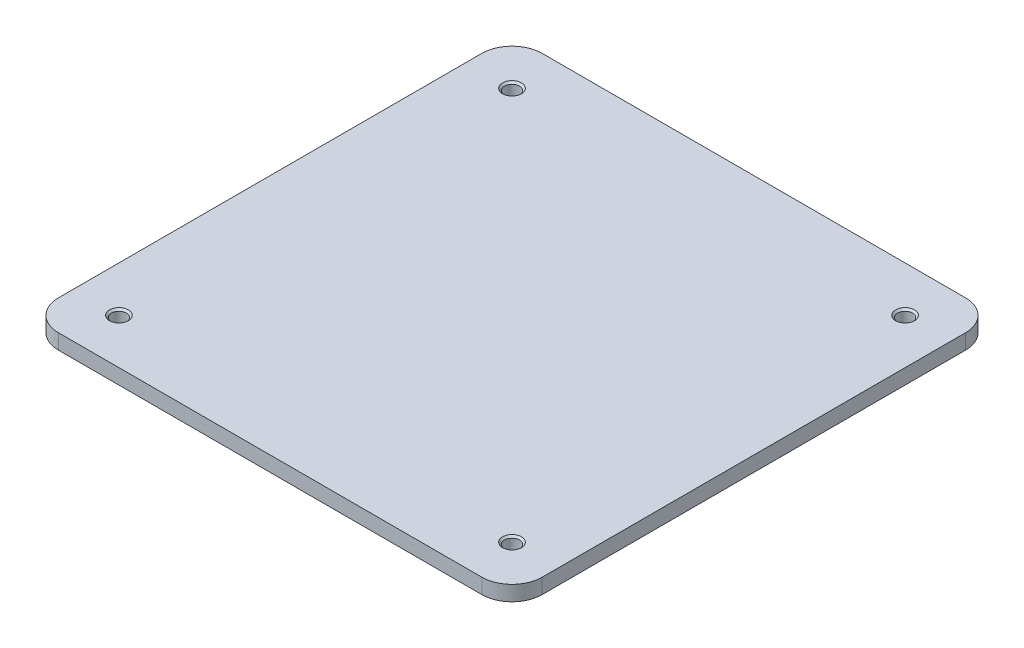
ISO-10303-21;
HEADER;
FILE_DESCRIPTION(('STEP AP214'),'2;1');
FILE_NAME('part.step','',(''),(''),'','','');
FILE_SCHEMA(('AUTOMOTIVE_DESIGN { 1 0 10303 214 1 1 1 1 }'));
ENDSEC;
DATA;
#1=APPLICATION_CONTEXT('core data for automotive mechanical design processes');
#2=APPLICATION_PROTOCOL_DEFINITION('international standard','automotive_design',2000,#1);
#3=PRODUCT_CONTEXT('',#1,'mechanical');
#4=PRODUCT('Part','Part','',(#3));
#5=PRODUCT_RELATED_PRODUCT_CATEGORY('part','',(#4));
#6=PRODUCT_DEFINITION_FORMATION('','',#4);
#7=PRODUCT_DEFINITION_CONTEXT('part definition',#1,'design');
#8=PRODUCT_DEFINITION('design','',#6,#7);
#9=PRODUCT_DEFINITION_SHAPE('','',#8);
#10=(LENGTH_UNIT() NAMED_UNIT(*) SI_UNIT(.MILLI.,.METRE.));
#11=(NAMED_UNIT(*) PLANE_ANGLE_UNIT() SI_UNIT($,.RADIAN.));
#12=(NAMED_UNIT(*) SI_UNIT($,.STERADIAN.) SOLID_ANGLE_UNIT());
#13=UNCERTAINTY_MEASURE_WITH_UNIT(LENGTH_MEASURE(1.E-05),#10,'distance_accuracy_value','');
#14=(GEOMETRIC_REPRESENTATION_CONTEXT(3) GLOBAL_UNCERTAINTY_ASSIGNED_CONTEXT((#13)) GLOBAL_UNIT_ASSIGNED_CONTEXT((#10,
#11,#12)) REPRESENTATION_CONTEXT('',''));
#15=CARTESIAN_POINT('',(0.,0.,0.));
#16=DIRECTION('',(0.,0.,1.));
#17=DIRECTION('',(1.,0.,0.));
#18=AXIS2_PLACEMENT_3D('',#15,#16,#17);
#19=CARTESIAN_POINT('',(101.6,6.35,-101.6));
#20=DIRECTION('',(-1.,0.,0.));
#21=DIRECTION('',(0.,0.,1.));
#22=AXIS2_PLACEMENT_3D('',#19,#20,#21);
#23=PLANE('',#22);
#24=DIRECTION('',(0.,0.,-1.));
#25=VECTOR('',#24,1.);
#26=CARTESIAN_POINT('',(101.6,6.35,-101.6));
#27=LINE('',#26,#25);
#28=CARTESIAN_POINT('',(101.6,6.35,88.9));
#29=VERTEX_POINT('',#28);
#30=CARTESIAN_POINT('',(101.6,6.35,-88.9));
#31=VERTEX_POINT('',#30);
#32=EDGE_CURVE('E133',#29,#31,#27,.T.);
#33=ORIENTED_EDGE('',*,*,#32,.F.);
#34=DIRECTION('',(0.,-1.,0.));
#35=VECTOR('',#34,1.);
#36=CARTESIAN_POINT('',(101.6,6.35,88.9));
#37=LINE('',#36,#35);
#38=CARTESIAN_POINT('',(101.6,0.,88.9));
#39=VERTEX_POINT('',#38);
#40=EDGE_CURVE('E118',#29,#39,#37,.T.);
#41=ORIENTED_EDGE('',*,*,#40,.T.);
#42=DIRECTION('',(0.,0.,-1.));
#43=VECTOR('',#42,1.);
#44=CARTESIAN_POINT('',(101.6,0.,-101.6));
#45=LINE('',#44,#43);
#46=CARTESIAN_POINT('',(101.6,0.,-88.9));
#47=VERTEX_POINT('',#46);
#48=EDGE_CURVE('E130',#39,#47,#45,.T.);
#49=ORIENTED_EDGE('',*,*,#48,.T.);
#50=DIRECTION('',(0.,-1.,0.));
#51=VECTOR('',#50,1.);
#52=CARTESIAN_POINT('',(101.6,6.35,-88.9));
#53=LINE('',#52,#51);
#54=EDGE_CURVE('E135',#47,#31,#53,.F.);
#55=ORIENTED_EDGE('',*,*,#54,.T.);
#56=EDGE_LOOP('',(#33,#41,#49,#55));
#57=FACE_BOUND('',#56,.T.);
#58=ADVANCED_FACE('F48',(#57),#23,.F.);
#59=CARTESIAN_POINT('',(-101.6,6.35,-101.6));
#60=DIRECTION('',(0.,0.,1.));
#61=DIRECTION('',(1.,0.,0.));
#62=AXIS2_PLACEMENT_3D('',#59,#60,#61);
#63=PLANE('',#62);
#64=DIRECTION('',(-1.,0.,0.));
#65=VECTOR('',#64,1.);
#66=CARTESIAN_POINT('',(-101.6,0.,-101.6));
#67=LINE('',#66,#65);
#68=CARTESIAN_POINT('',(88.9,0.,-101.6));
#69=VERTEX_POINT('',#68);
#70=CARTESIAN_POINT('',(-88.9,0.,-101.6));
#71=VERTEX_POINT('',#70);
#72=EDGE_CURVE('E139',#69,#71,#67,.T.);
#73=ORIENTED_EDGE('',*,*,#72,.T.);
#74=DIRECTION('',(0.,-1.,0.));
#75=VECTOR('',#74,1.);
#76=CARTESIAN_POINT('',(-88.9,6.35,-101.6));
#77=LINE('',#76,#75);
#78=CARTESIAN_POINT('',(-88.9,6.35,-101.6));
#79=VERTEX_POINT('',#78);
#80=EDGE_CURVE('E13',#71,#79,#77,.F.);
#81=ORIENTED_EDGE('',*,*,#80,.T.);
#82=DIRECTION('',(-1.,0.,0.));
#83=VECTOR('',#82,1.);
#84=CARTESIAN_POINT('',(-101.6,6.35,-101.6));
#85=LINE('',#84,#83);
#86=CARTESIAN_POINT('',(88.9,6.35,-101.6));
#87=VERTEX_POINT('',#86);
#88=EDGE_CURVE('E203',#87,#79,#85,.T.);
#89=ORIENTED_EDGE('',*,*,#88,.F.);
#90=DIRECTION('',(0.,-1.,0.));
#91=VECTOR('',#90,1.);
#92=CARTESIAN_POINT('',(88.9,6.35,-101.6));
#93=LINE('',#92,#91);
#94=EDGE_CURVE('E56',#87,#69,#93,.T.);
#95=ORIENTED_EDGE('',*,*,#94,.T.);
#96=EDGE_LOOP('',(#73,#81,#89,#95));
#97=FACE_BOUND('',#96,.T.);
#98=ADVANCED_FACE('F201',(#97),#63,.F.);
#99=CARTESIAN_POINT('',(-101.6,6.35,-101.6));
#100=DIRECTION('',(1.,0.,0.));
#101=DIRECTION('',(0.,0.,-1.));
#102=AXIS2_PLACEMENT_3D('',#99,#100,#101);
#103=PLANE('',#102);
#104=DIRECTION('',(0.,0.,1.));
#105=VECTOR('',#104,1.);
#106=CARTESIAN_POINT('',(-101.6,0.,-101.6));
#107=LINE('',#106,#105);
#108=CARTESIAN_POINT('',(-101.6,0.,-88.9));
#109=VERTEX_POINT('',#108);
#110=CARTESIAN_POINT('',(-101.6,0.,88.9));
#111=VERTEX_POINT('',#110);
#112=EDGE_CURVE('E143',#109,#111,#107,.T.);
#113=ORIENTED_EDGE('',*,*,#112,.T.);
#114=DIRECTION('',(0.,-1.,0.));
#115=VECTOR('',#114,1.);
#116=CARTESIAN_POINT('',(-101.6,6.35,88.9));
#117=LINE('',#116,#115);
#118=CARTESIAN_POINT('',(-101.6,6.35,88.9));
#119=VERTEX_POINT('',#118);
#120=EDGE_CURVE('E63',#111,#119,#117,.F.);
#121=ORIENTED_EDGE('',*,*,#120,.T.);
#122=DIRECTION('',(0.,0.,1.));
#123=VECTOR('',#122,1.);
#124=CARTESIAN_POINT('',(-101.6,6.35,-101.6));
#125=LINE('',#124,#123);
#126=CARTESIAN_POINT('',(-101.6,6.35,-88.9));
#127=VERTEX_POINT('',#126);
#128=EDGE_CURVE('E211',#127,#119,#125,.T.);
#129=ORIENTED_EDGE('',*,*,#128,.F.);
#130=DIRECTION('',(0.,-1.,0.));
#131=VECTOR('',#130,1.);
#132=CARTESIAN_POINT('',(-101.6,6.35,-88.9));
#133=LINE('',#132,#131);
#134=EDGE_CURVE('E194',#127,#109,#133,.T.);
#135=ORIENTED_EDGE('',*,*,#134,.T.);
#136=EDGE_LOOP('',(#113,#121,#129,#135));
#137=FACE_BOUND('',#136,.T.);
#138=ADVANCED_FACE('F210',(#137),#103,.F.);
#139=CARTESIAN_POINT('',(-101.6,6.35,101.6));
#140=DIRECTION('',(0.,0.,-1.));
#141=DIRECTION('',(-1.,0.,0.));
#142=AXIS2_PLACEMENT_3D('',#139,#140,#141);
#143=PLANE('',#142);
#144=DIRECTION('',(1.,0.,0.));
#145=VECTOR('',#144,1.);
#146=CARTESIAN_POINT('',(-101.6,0.,101.6));
#147=LINE('',#146,#145);
#148=CARTESIAN_POINT('',(-88.9,0.,101.6));
#149=VERTEX_POINT('',#148);
#150=CARTESIAN_POINT('',(88.9,0.,101.6));
#151=VERTEX_POINT('',#150);
#152=EDGE_CURVE('E153',#149,#151,#147,.T.);
#153=ORIENTED_EDGE('',*,*,#152,.T.);
#154=DIRECTION('',(0.,-1.,0.));
#155=VECTOR('',#154,1.);
#156=CARTESIAN_POINT('',(88.9,6.35,101.6));
#157=LINE('',#156,#155);
#158=CARTESIAN_POINT('',(88.9,6.35,101.6));
#159=VERTEX_POINT('',#158);
#160=EDGE_CURVE('E119',#151,#159,#157,.F.);
#161=ORIENTED_EDGE('',*,*,#160,.T.);
#162=DIRECTION('',(1.,0.,0.));
#163=VECTOR('',#162,1.);
#164=CARTESIAN_POINT('',(-101.6,6.35,101.6));
#165=LINE('',#164,#163);
#166=CARTESIAN_POINT('',(-88.9,6.35,101.6));
#167=VERTEX_POINT('',#166);
#168=EDGE_CURVE('E149',#167,#159,#165,.T.);
#169=ORIENTED_EDGE('',*,*,#168,.F.);
#170=DIRECTION('',(0.,-1.,0.));
#171=VECTOR('',#170,1.);
#172=CARTESIAN_POINT('',(-88.9,6.35,101.6));
#173=LINE('',#172,#171);
#174=EDGE_CURVE('E124',#167,#149,#173,.T.);
#175=ORIENTED_EDGE('',*,*,#174,.T.);
#176=EDGE_LOOP('',(#153,#161,#169,#175));
#177=FACE_BOUND('',#176,.T.);
#178=ADVANCED_FACE('F282',(#177),#143,.F.);
#179=CARTESIAN_POINT('',(0.,6.35,0.));
#180=DIRECTION('',(0.,1.,0.));
#181=DIRECTION('',(0.,0.,1.));
#182=AXIS2_PLACEMENT_3D('',#179,#180,#181);
#183=PLANE('',#182);
#184=CARTESIAN_POINT('',(-82.55,6.35,82.55));
#185=DIRECTION('',(0.,1.,0.));
#186=DIRECTION('',(0.,0.,1.));
#187=AXIS2_PLACEMENT_3D('',#184,#185,#186);
#188=CIRCLE('',#187,3.96875000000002);
#189=CARTESIAN_POINT('',(-82.55,6.35,86.51875));
#190=VERTEX_POINT('',#189);
#191=EDGE_CURVE('E167',#190,#190,#188,.F.);
#192=ORIENTED_EDGE('',*,*,#191,.T.);
#193=EDGE_LOOP('',(#192));
#194=FACE_BOUND('',#193,.T.);
#195=CARTESIAN_POINT('',(82.55,6.35,82.55));
#196=DIRECTION('',(0.,1.,0.));
#197=DIRECTION('',(0.,0.,1.));
#198=AXIS2_PLACEMENT_3D('',#195,#196,#197);
#199=CIRCLE('',#198,3.96875000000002);
#200=CARTESIAN_POINT('',(82.55,6.35,86.51875));
#201=VERTEX_POINT('',#200);
#202=EDGE_CURVE('E164',#201,#201,#199,.F.);
#203=ORIENTED_EDGE('',*,*,#202,.T.);
#204=EDGE_LOOP('',(#203));
#205=FACE_BOUND('',#204,.T.);
#206=CARTESIAN_POINT('',(82.55,6.35,-82.55));
#207=DIRECTION('',(0.,1.,0.));
#208=DIRECTION('',(0.,0.,1.));
#209=AXIS2_PLACEMENT_3D('',#206,#207,#208);
#210=CIRCLE('',#209,3.96874999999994);
#211=CARTESIAN_POINT('',(82.55,6.35,-78.5812500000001));
#212=VERTEX_POINT('',#211);
#213=EDGE_CURVE('E161',#212,#212,#210,.F.);
#214=ORIENTED_EDGE('',*,*,#213,.T.);
#215=EDGE_LOOP('',(#214));
#216=FACE_BOUND('',#215,.T.);
#217=CARTESIAN_POINT('',(-82.55,6.35,-82.55));
#218=DIRECTION('',(0.,1.,0.));
#219=DIRECTION('',(0.,0.,1.));
#220=AXIS2_PLACEMENT_3D('',#217,#218,#219);
#221=CIRCLE('',#220,3.96874999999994);
#222=CARTESIAN_POINT('',(-82.55,6.35,-78.5812500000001));
#223=VERTEX_POINT('',#222);
#224=EDGE_CURVE('E158',#223,#223,#221,.F.);
#225=ORIENTED_EDGE('',*,*,#224,.T.);
#226=EDGE_LOOP('',(#225));
#227=FACE_BOUND('',#226,.T.);
#228=ORIENTED_EDGE('',*,*,#168,.T.);
#229=CARTESIAN_POINT('',(88.9,6.35,88.9));
#230=DIRECTION('',(0.,1.,0.));
#231=DIRECTION('',(0.,0.,1.));
#232=AXIS2_PLACEMENT_3D('',#229,#230,#231);
#233=CIRCLE('',#232,12.7);
#234=EDGE_CURVE('E192',#159,#29,#233,.T.);
#235=ORIENTED_EDGE('',*,*,#234,.T.);
#236=ORIENTED_EDGE('',*,*,#32,.T.);
#237=CARTESIAN_POINT('',(88.9,6.35,-88.9));
#238=DIRECTION('',(0.,1.,0.));
#239=DIRECTION('',(0.,0.,1.));
#240=AXIS2_PLACEMENT_3D('',#237,#238,#239);
#241=CIRCLE('',#240,12.7);
#242=EDGE_CURVE('E187',#31,#87,#241,.T.);
#243=ORIENTED_EDGE('',*,*,#242,.T.);
#244=ORIENTED_EDGE('',*,*,#88,.T.);
#245=CARTESIAN_POINT('',(-88.9,6.35,-88.9));
#246=DIRECTION('',(0.,1.,0.));
#247=DIRECTION('',(0.,0.,1.));
#248=AXIS2_PLACEMENT_3D('',#245,#246,#247);
#249=CIRCLE('',#248,12.7);
#250=EDGE_CURVE('E70',#79,#127,#249,.T.);
#251=ORIENTED_EDGE('',*,*,#250,.T.);
#252=ORIENTED_EDGE('',*,*,#128,.T.);
#253=CARTESIAN_POINT('',(-88.9,6.35,88.9));
#254=DIRECTION('',(0.,1.,0.));
#255=DIRECTION('',(0.,0.,1.));
#256=AXIS2_PLACEMENT_3D('',#253,#254,#255);
#257=CIRCLE('',#256,12.7);
#258=EDGE_CURVE('E190',#119,#167,#257,.T.);
#259=ORIENTED_EDGE('',*,*,#258,.T.);
#260=EDGE_LOOP('',(#228,#235,#236,#243,#244,#251,#252,#259));
#261=FACE_BOUND('',#260,.T.);
#262=ADVANCED_FACE('F278',(#194,#205,#216,#227,#261),#183,.T.);
#263=CARTESIAN_POINT('',(0.,0.,0.));
#264=DIRECTION('',(0.,1.,0.));
#265=DIRECTION('',(0.,0.,1.));
#266=AXIS2_PLACEMENT_3D('',#263,#264,#265);
#267=PLANE('',#266);
#268=CARTESIAN_POINT('',(-82.55,0.,82.55));
#269=DIRECTION('',(0.,1.,0.));
#270=DIRECTION('',(0.,0.,1.));
#271=AXIS2_PLACEMENT_3D('',#268,#269,#270);
#272=CIRCLE('',#271,3.175);
#273=CARTESIAN_POINT('',(-82.55,0.,85.725));
#274=VERTEX_POINT('',#273);
#275=EDGE_CURVE('E217',#274,#274,#272,.T.);
#276=ORIENTED_EDGE('',*,*,#275,.T.);
#277=EDGE_LOOP('',(#276));
#278=FACE_BOUND('',#277,.T.);
#279=CARTESIAN_POINT('',(82.55,0.,82.55));
#280=DIRECTION('',(0.,1.,0.));
#281=DIRECTION('',(0.,0.,1.));
#282=AXIS2_PLACEMENT_3D('',#279,#280,#281);
#283=CIRCLE('',#282,3.175);
#284=CARTESIAN_POINT('',(82.55,0.,85.725));
#285=VERTEX_POINT('',#284);
#286=EDGE_CURVE('E220',#285,#285,#283,.T.);
#287=ORIENTED_EDGE('',*,*,#286,.T.);
#288=EDGE_LOOP('',(#287));
#289=FACE_BOUND('',#288,.T.);
#290=CARTESIAN_POINT('',(82.55,0.,-82.55));
#291=DIRECTION('',(0.,1.,0.));
#292=DIRECTION('',(0.,0.,1.));
#293=AXIS2_PLACEMENT_3D('',#290,#291,#292);
#294=CIRCLE('',#293,3.175);
#295=CARTESIAN_POINT('',(82.55,0.,-79.375));
#296=VERTEX_POINT('',#295);
#297=EDGE_CURVE('E146',#296,#296,#294,.T.);
#298=ORIENTED_EDGE('',*,*,#297,.T.);
#299=EDGE_LOOP('',(#298));
#300=FACE_BOUND('',#299,.T.);
#301=CARTESIAN_POINT('',(-82.55,0.,-82.55));
#302=DIRECTION('',(0.,1.,0.));
#303=DIRECTION('',(0.,0.,1.));
#304=AXIS2_PLACEMENT_3D('',#301,#302,#303);
#305=CIRCLE('',#304,3.175);
#306=CARTESIAN_POINT('',(-82.55,0.,-79.375));
#307=VERTEX_POINT('',#306);
#308=EDGE_CURVE('E140',#307,#307,#305,.T.);
#309=ORIENTED_EDGE('',*,*,#308,.T.);
#310=EDGE_LOOP('',(#309));
#311=FACE_BOUND('',#310,.T.);
#312=ORIENTED_EDGE('',*,*,#48,.F.);
#313=CARTESIAN_POINT('',(88.9,0.,88.9));
#314=DIRECTION('',(0.,1.,0.));
#315=DIRECTION('',(0.,0.,1.));
#316=AXIS2_PLACEMENT_3D('',#313,#314,#315);
#317=CIRCLE('',#316,12.7);
#318=EDGE_CURVE('E114',#39,#151,#317,.F.);
#319=ORIENTED_EDGE('',*,*,#318,.T.);
#320=ORIENTED_EDGE('',*,*,#152,.F.);
#321=CARTESIAN_POINT('',(-88.9,0.,88.9));
#322=DIRECTION('',(0.,1.,0.));
#323=DIRECTION('',(0.,0.,1.));
#324=AXIS2_PLACEMENT_3D('',#321,#322,#323);
#325=CIRCLE('',#324,12.7);
#326=EDGE_CURVE('E125',#149,#111,#325,.F.);
#327=ORIENTED_EDGE('',*,*,#326,.T.);
#328=ORIENTED_EDGE('',*,*,#112,.F.);
#329=CARTESIAN_POINT('',(-88.9,0.,-88.9));
#330=DIRECTION('',(0.,1.,0.));
#331=DIRECTION('',(0.,0.,1.));
#332=AXIS2_PLACEMENT_3D('',#329,#330,#331);
#333=CIRCLE('',#332,12.7);
#334=EDGE_CURVE('E181',#109,#71,#333,.F.);
#335=ORIENTED_EDGE('',*,*,#334,.T.);
#336=ORIENTED_EDGE('',*,*,#72,.F.);
#337=CARTESIAN_POINT('',(88.9,0.,-88.9));
#338=DIRECTION('',(0.,1.,0.));
#339=DIRECTION('',(0.,0.,1.));
#340=AXIS2_PLACEMENT_3D('',#337,#338,#339);
#341=CIRCLE('',#340,12.7);
#342=EDGE_CURVE('E134',#69,#47,#341,.F.);
#343=ORIENTED_EDGE('',*,*,#342,.T.);
#344=EDGE_LOOP('',(#312,#319,#320,#327,#328,#335,#336,#343));
#345=FACE_BOUND('',#344,.T.);
#346=ADVANCED_FACE('F137',(#278,#289,#300,#311,#345),#267,.F.);
#347=CARTESIAN_POINT('',(-82.55,0.,-82.55));
#348=DIRECTION('',(0.,1.,0.));
#349=DIRECTION('',(0.,0.,1.));
#350=AXIS2_PLACEMENT_3D('',#347,#348,#349);
#351=CYLINDRICAL_SURFACE('',#350,3.175);
#352=CARTESIAN_POINT('',(-82.55,5.55625000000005,-82.55));
#353=DIRECTION('',(0.,1.,0.));
#354=DIRECTION('',(0.,0.,1.));
#355=AXIS2_PLACEMENT_3D('',#352,#353,#354);
#356=CIRCLE('',#355,3.175);
#357=CARTESIAN_POINT('',(-82.55,5.55625000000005,-79.375));
#358=VERTEX_POINT('',#357);
#359=EDGE_CURVE('E176',#358,#358,#356,.T.);
#360=ORIENTED_EDGE('',*,*,#359,.T.);
#361=EDGE_LOOP('',(#360));
#362=FACE_BOUND('',#361,.T.);
#363=ORIENTED_EDGE('',*,*,#308,.F.);
#364=EDGE_LOOP('',(#363));
#365=FACE_BOUND('',#364,.T.);
#366=ADVANCED_FACE('F231',(#362,#365),#351,.F.);
#367=CARTESIAN_POINT('',(82.55,0.,-82.55));
#368=DIRECTION('',(0.,1.,0.));
#369=DIRECTION('',(0.,0.,1.));
#370=AXIS2_PLACEMENT_3D('',#367,#368,#369);
#371=CYLINDRICAL_SURFACE('',#370,3.175);
#372=CARTESIAN_POINT('',(82.55,5.55625000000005,-82.55));
#373=DIRECTION('',(0.,1.,0.));
#374=DIRECTION('',(0.,0.,1.));
#375=AXIS2_PLACEMENT_3D('',#372,#373,#374);
#376=CIRCLE('',#375,3.175);
#377=CARTESIAN_POINT('',(82.55,5.55625000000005,-79.375));
#378=VERTEX_POINT('',#377);
#379=EDGE_CURVE('E173',#378,#378,#376,.T.);
#380=ORIENTED_EDGE('',*,*,#379,.T.);
#381=EDGE_LOOP('',(#380));
#382=FACE_BOUND('',#381,.T.);
#383=ORIENTED_EDGE('',*,*,#297,.F.);
#384=EDGE_LOOP('',(#383));
#385=FACE_BOUND('',#384,.T.);
#386=ADVANCED_FACE('F228',(#382,#385),#371,.F.);
#387=CARTESIAN_POINT('',(82.55,0.,82.55));
#388=DIRECTION('',(0.,1.,0.));
#389=DIRECTION('',(0.,0.,1.));
#390=AXIS2_PLACEMENT_3D('',#387,#388,#389);
#391=CYLINDRICAL_SURFACE('',#390,3.175);
#392=CARTESIAN_POINT('',(82.55,5.55624999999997,82.55));
#393=DIRECTION('',(0.,1.,0.));
#394=DIRECTION('',(0.,0.,1.));
#395=AXIS2_PLACEMENT_3D('',#392,#393,#394);
#396=CIRCLE('',#395,3.175);
#397=CARTESIAN_POINT('',(82.55,5.55624999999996,85.725));
#398=VERTEX_POINT('',#397);
#399=EDGE_CURVE('E170',#398,#398,#396,.T.);
#400=ORIENTED_EDGE('',*,*,#399,.T.);
#401=EDGE_LOOP('',(#400));
#402=FACE_BOUND('',#401,.T.);
#403=ORIENTED_EDGE('',*,*,#286,.F.);
#404=EDGE_LOOP('',(#403));
#405=FACE_BOUND('',#404,.T.);
#406=ADVANCED_FACE('F230',(#402,#405),#391,.F.);
#407=CARTESIAN_POINT('',(-82.55,0.,82.55));
#408=DIRECTION('',(0.,1.,0.));
#409=DIRECTION('',(0.,0.,1.));
#410=AXIS2_PLACEMENT_3D('',#407,#408,#409);
#411=CYLINDRICAL_SURFACE('',#410,3.175);
#412=CARTESIAN_POINT('',(-82.55,5.55624999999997,82.55));
#413=DIRECTION('',(0.,1.,0.));
#414=DIRECTION('',(0.,0.,1.));
#415=AXIS2_PLACEMENT_3D('',#412,#413,#414);
#416=CIRCLE('',#415,3.175);
#417=CARTESIAN_POINT('',(-82.55,5.55624999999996,85.725));
#418=VERTEX_POINT('',#417);
#419=EDGE_CURVE('E155',#418,#418,#416,.T.);
#420=ORIENTED_EDGE('',*,*,#419,.T.);
#421=EDGE_LOOP('',(#420));
#422=FACE_BOUND('',#421,.T.);
#423=ORIENTED_EDGE('',*,*,#275,.F.);
#424=EDGE_LOOP('',(#423));
#425=FACE_BOUND('',#424,.T.);
#426=ADVANCED_FACE('F238',(#422,#425),#411,.F.);
#427=CARTESIAN_POINT('',(-82.55,5.55624999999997,82.55));
#428=DIRECTION('',(0.,1.,0.));
#429=DIRECTION('',(0.,0.,1.));
#430=AXIS2_PLACEMENT_3D('',#427,#428,#429);
#431=CONICAL_SURFACE('',#430,3.175,0.785398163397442);
#432=CARTESIAN_POINT('',(-82.55,6.35,86.51875));
#433=CARTESIAN_POINT('',(-82.55,6.34173177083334,86.5104817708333));
#434=CARTESIAN_POINT('',(-82.55,6.33346354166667,86.5022135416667));
#435=CARTESIAN_POINT('',(-82.55,6.31692708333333,86.4856770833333));
#436=CARTESIAN_POINT('',(-82.55,6.30865885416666,86.4774088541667));
#437=CARTESIAN_POINT('',(-82.55,6.29212239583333,86.4608723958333));
#438=CARTESIAN_POINT('',(-82.55,6.28385416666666,86.4526041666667));
#439=CARTESIAN_POINT('',(-82.55,6.26731770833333,86.4360677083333));
#440=CARTESIAN_POINT('',(-82.55,6.25904947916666,86.4277994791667));
#441=CARTESIAN_POINT('',(-82.55,6.24251302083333,86.4112630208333));
#442=CARTESIAN_POINT('',(-82.55,6.23424479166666,86.4029947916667));
#443=CARTESIAN_POINT('',(-82.55,6.21770833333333,86.3864583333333));
#444=CARTESIAN_POINT('',(-82.55,6.20944010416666,86.3781901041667));
#445=CARTESIAN_POINT('',(-82.55,6.19290364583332,86.3616536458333));
#446=CARTESIAN_POINT('',(-82.55,6.18463541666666,86.3533854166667));
#447=CARTESIAN_POINT('',(-82.55,6.16809895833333,86.3368489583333));
#448=CARTESIAN_POINT('',(-82.55,6.15983072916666,86.3285807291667));
#449=CARTESIAN_POINT('',(-82.55,6.14329427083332,86.3120442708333));
#450=CARTESIAN_POINT('',(-82.55,6.13502604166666,86.3037760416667));
#451=CARTESIAN_POINT('',(-82.55,6.11848958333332,86.2872395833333));
#452=CARTESIAN_POINT('',(-82.55,6.11022135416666,86.2789713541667));
#453=CARTESIAN_POINT('',(-82.55,6.09368489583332,86.2624348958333));
#454=CARTESIAN_POINT('',(-82.55,6.08541666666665,86.2541666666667));
#455=CARTESIAN_POINT('',(-82.55,6.06888020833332,86.2376302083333));
#456=CARTESIAN_POINT('',(-82.55,6.06061197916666,86.2293619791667));
#457=CARTESIAN_POINT('',(-82.55,6.04407552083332,86.2128255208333));
#458=CARTESIAN_POINT('',(-82.55,6.03580729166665,86.2045572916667));
#459=CARTESIAN_POINT('',(-82.55,6.01927083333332,86.1880208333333));
#460=CARTESIAN_POINT('',(-82.55,6.01100260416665,86.1797526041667));
#461=CARTESIAN_POINT('',(-82.55,5.99446614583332,86.1632161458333));
#462=CARTESIAN_POINT('',(-82.55,5.98619791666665,86.1549479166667));
#463=CARTESIAN_POINT('',(-82.55,5.96966145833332,86.1384114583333));
#464=CARTESIAN_POINT('',(-82.55,5.96139322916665,86.1301432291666));
#465=CARTESIAN_POINT('',(-82.55,5.94485677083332,86.1136067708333));
#466=CARTESIAN_POINT('',(-82.55,5.93658854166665,86.1053385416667));
#467=CARTESIAN_POINT('',(-82.55,5.92005208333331,86.0888020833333));
#468=CARTESIAN_POINT('',(-82.55,5.91178385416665,86.0805338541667));
#469=CARTESIAN_POINT('',(-82.55,5.89524739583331,86.0639973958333));
#470=CARTESIAN_POINT('',(-82.55,5.88697916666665,86.0557291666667));
#471=CARTESIAN_POINT('',(-82.55,5.87044270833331,86.0391927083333));
#472=CARTESIAN_POINT('',(-82.55,5.86217447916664,86.0309244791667));
#473=CARTESIAN_POINT('',(-82.55,5.84563802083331,86.0143880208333));
#474=CARTESIAN_POINT('',(-82.55,5.83736979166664,86.0061197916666));
#475=CARTESIAN_POINT('',(-82.55,5.82083333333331,85.9895833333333));
#476=CARTESIAN_POINT('',(-82.55,5.81256510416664,85.9813151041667));
#477=CARTESIAN_POINT('',(-82.55,5.79602864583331,85.9647786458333));
#478=CARTESIAN_POINT('',(-82.55,5.78776041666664,85.9565104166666));
#479=CARTESIAN_POINT('',(-82.55,5.77122395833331,85.9399739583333));
#480=CARTESIAN_POINT('',(-82.55,5.76295572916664,85.9317057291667));
#481=CARTESIAN_POINT('',(-82.55,5.7464192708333,85.9151692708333));
#482=CARTESIAN_POINT('',(-82.55,5.73815104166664,85.9069010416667));
#483=CARTESIAN_POINT('',(-82.55,5.72161458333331,85.8903645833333));
#484=CARTESIAN_POINT('',(-82.55,5.71334635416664,85.8820963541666));
#485=CARTESIAN_POINT('',(-82.55,5.69680989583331,85.8655598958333));
#486=CARTESIAN_POINT('',(-82.55,5.68854166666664,85.8572916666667));
#487=CARTESIAN_POINT('',(-82.55,5.6720052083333,85.8407552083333));
#488=CARTESIAN_POINT('',(-82.55,5.66373697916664,85.8324869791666));
#489=CARTESIAN_POINT('',(-82.55,5.6472005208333,85.8159505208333));
#490=CARTESIAN_POINT('',(-82.55,5.63893229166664,85.8076822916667));
#491=CARTESIAN_POINT('',(-82.55,5.6223958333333,85.7911458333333));
#492=CARTESIAN_POINT('',(-82.55,5.61412760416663,85.7828776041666));
#493=CARTESIAN_POINT('',(-82.55,5.5975911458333,85.7663411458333));
#494=CARTESIAN_POINT('',(-82.55,5.58932291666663,85.7580729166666));
#495=CARTESIAN_POINT('',(-82.55,5.5727864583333,85.7415364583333));
#496=CARTESIAN_POINT('',(-82.55,5.56451822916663,85.7332682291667));
#497=CARTESIAN_POINT('',(-82.55,5.55624999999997,85.725));
#498=B_SPLINE_CURVE_WITH_KNOTS('',3,(#432,#433,#434,#435,#436,#437,#438,#439,#440,#441,#442,
#443,#444,#445,#446,#447,#448,#449,#450,#451,#452,#453,#454,#455,#456,#457,#458,#459,#460,#461,
#462,#463,#464,#465,#466,#467,#468,#469,#470,#471,#472,#473,#474,#475,#476,#477,#478,#479,#480,
#481,#482,#483,#484,#485,#486,#487,#488,#489,#490,#491,#492,#493,#494,#495,#496,#497),
.UNSPECIFIED.,.F.,.F.,(4,2,2,2,2,2,2,2,2,2,2,2,2,2,2,2,2,2,2,2,2,2,2,2,2,2,2,2,2,2,2,2,4),(0.,
0.0350791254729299,0.0701582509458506,0.105237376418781,0.140316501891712,0.175395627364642,
0.210474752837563,0.245553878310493,0.280633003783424,0.315712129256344,0.350791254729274,
0.385870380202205,0.420949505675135,0.456028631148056,0.491107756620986,0.526186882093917,
0.561266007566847,0.596345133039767,0.631424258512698,0.666503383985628,0.701582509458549,
0.73666163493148,0.77174076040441,0.80681988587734,0.841899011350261,0.876978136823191,
0.912057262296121,0.947136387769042,0.982215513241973,1.0172946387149,1.05237376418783,
1.08745288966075,1.12253201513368),.UNSPECIFIED.);
#499=EDGE_CURVE('BSEAM251',#190,#418,#498,.T.);
#500=ORIENTED_EDGE('',*,*,#191,.F.);
#501=ORIENTED_EDGE('',*,*,#419,.F.);
#502=ORIENTED_EDGE('',*,*,#499,.T.);
#503=ORIENTED_EDGE('',*,*,#499,.F.);
#504=EDGE_LOOP('',(#500,#502,#501,#503));
#505=FACE_BOUND('',#504,.T.);
#506=ADVANCED_FACE('F251',(#505),#431,.F.);
#507=CARTESIAN_POINT('',(82.55,5.55624999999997,82.55));
#508=DIRECTION('',(0.,1.,0.));
#509=DIRECTION('',(0.,0.,1.));
#510=AXIS2_PLACEMENT_3D('',#507,#508,#509);
#511=CONICAL_SURFACE('',#510,3.175,0.785398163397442);
#512=CARTESIAN_POINT('',(82.55,6.35,86.51875));
#513=CARTESIAN_POINT('',(82.55,6.34173177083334,86.5104817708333));
#514=CARTESIAN_POINT('',(82.55,6.33346354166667,86.5022135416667));
#515=CARTESIAN_POINT('',(82.55,6.31692708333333,86.4856770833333));
#516=CARTESIAN_POINT('',(82.55,6.30865885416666,86.4774088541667));
#517=CARTESIAN_POINT('',(82.55,6.29212239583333,86.4608723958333));
#518=CARTESIAN_POINT('',(82.55,6.28385416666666,86.4526041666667));
#519=CARTESIAN_POINT('',(82.55,6.26731770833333,86.4360677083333));
#520=CARTESIAN_POINT('',(82.55,6.25904947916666,86.4277994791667));
#521=CARTESIAN_POINT('',(82.55,6.24251302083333,86.4112630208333));
#522=CARTESIAN_POINT('',(82.55,6.23424479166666,86.4029947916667));
#523=CARTESIAN_POINT('',(82.55,6.21770833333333,86.3864583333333));
#524=CARTESIAN_POINT('',(82.55,6.20944010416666,86.3781901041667));
#525=CARTESIAN_POINT('',(82.55,6.19290364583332,86.3616536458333));
#526=CARTESIAN_POINT('',(82.55,6.18463541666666,86.3533854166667));
#527=CARTESIAN_POINT('',(82.55,6.16809895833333,86.3368489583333));
#528=CARTESIAN_POINT('',(82.55,6.15983072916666,86.3285807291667));
#529=CARTESIAN_POINT('',(82.55,6.14329427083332,86.3120442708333));
#530=CARTESIAN_POINT('',(82.55,6.13502604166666,86.3037760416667));
#531=CARTESIAN_POINT('',(82.55,6.11848958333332,86.2872395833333));
#532=CARTESIAN_POINT('',(82.55,6.11022135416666,86.2789713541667));
#533=CARTESIAN_POINT('',(82.55,6.09368489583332,86.2624348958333));
#534=CARTESIAN_POINT('',(82.55,6.08541666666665,86.2541666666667));
#535=CARTESIAN_POINT('',(82.55,6.06888020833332,86.2376302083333));
#536=CARTESIAN_POINT('',(82.55,6.06061197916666,86.2293619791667));
#537=CARTESIAN_POINT('',(82.55,6.04407552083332,86.2128255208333));
#538=CARTESIAN_POINT('',(82.55,6.03580729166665,86.2045572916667));
#539=CARTESIAN_POINT('',(82.55,6.01927083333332,86.1880208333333));
#540=CARTESIAN_POINT('',(82.55,6.01100260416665,86.1797526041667));
#541=CARTESIAN_POINT('',(82.55,5.99446614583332,86.1632161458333));
#542=CARTESIAN_POINT('',(82.55,5.98619791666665,86.1549479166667));
#543=CARTESIAN_POINT('',(82.55,5.96966145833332,86.1384114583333));
#544=CARTESIAN_POINT('',(82.55,5.96139322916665,86.1301432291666));
#545=CARTESIAN_POINT('',(82.55,5.94485677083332,86.1136067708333));
#546=CARTESIAN_POINT('',(82.55,5.93658854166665,86.1053385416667));
#547=CARTESIAN_POINT('',(82.55,5.92005208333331,86.0888020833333));
#548=CARTESIAN_POINT('',(82.55,5.91178385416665,86.0805338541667));
#549=CARTESIAN_POINT('',(82.55,5.89524739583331,86.0639973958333));
#550=CARTESIAN_POINT('',(82.55,5.88697916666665,86.0557291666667));
#551=CARTESIAN_POINT('',(82.55,5.87044270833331,86.0391927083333));
#552=CARTESIAN_POINT('',(82.55,5.86217447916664,86.0309244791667));
#553=CARTESIAN_POINT('',(82.55,5.84563802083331,86.0143880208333));
#554=CARTESIAN_POINT('',(82.55,5.83736979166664,86.0061197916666));
#555=CARTESIAN_POINT('',(82.55,5.82083333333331,85.9895833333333));
#556=CARTESIAN_POINT('',(82.55,5.81256510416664,85.9813151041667));
#557=CARTESIAN_POINT('',(82.55,5.79602864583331,85.9647786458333));
#558=CARTESIAN_POINT('',(82.55,5.78776041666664,85.9565104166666));
#559=CARTESIAN_POINT('',(82.55,5.77122395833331,85.9399739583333));
#560=CARTESIAN_POINT('',(82.55,5.76295572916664,85.9317057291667));
#561=CARTESIAN_POINT('',(82.55,5.7464192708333,85.9151692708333));
#562=CARTESIAN_POINT('',(82.55,5.73815104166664,85.9069010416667));
#563=CARTESIAN_POINT('',(82.55,5.72161458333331,85.8903645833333));
#564=CARTESIAN_POINT('',(82.55,5.71334635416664,85.8820963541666));
#565=CARTESIAN_POINT('',(82.55,5.69680989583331,85.8655598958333));
#566=CARTESIAN_POINT('',(82.55,5.68854166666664,85.8572916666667));
#567=CARTESIAN_POINT('',(82.55,5.6720052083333,85.8407552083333));
#568=CARTESIAN_POINT('',(82.55,5.66373697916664,85.8324869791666));
#569=CARTESIAN_POINT('',(82.55,5.6472005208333,85.8159505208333));
#570=CARTESIAN_POINT('',(82.55,5.63893229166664,85.8076822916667));
#571=CARTESIAN_POINT('',(82.55,5.6223958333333,85.7911458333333));
#572=CARTESIAN_POINT('',(82.55,5.61412760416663,85.7828776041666));
#573=CARTESIAN_POINT('',(82.55,5.5975911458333,85.7663411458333));
#574=CARTESIAN_POINT('',(82.55,5.58932291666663,85.7580729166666));
#575=CARTESIAN_POINT('',(82.55,5.5727864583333,85.7415364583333));
#576=CARTESIAN_POINT('',(82.55,5.56451822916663,85.7332682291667));
#577=CARTESIAN_POINT('',(82.55,5.55624999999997,85.725));
#578=B_SPLINE_CURVE_WITH_KNOTS('',3,(#512,#513,#514,#515,#516,#517,#518,#519,#520,#521,#522,
#523,#524,#525,#526,#527,#528,#529,#530,#531,#532,#533,#534,#535,#536,#537,#538,#539,#540,#541,
#542,#543,#544,#545,#546,#547,#548,#549,#550,#551,#552,#553,#554,#555,#556,#557,#558,#559,#560,
#561,#562,#563,#564,#565,#566,#567,#568,#569,#570,#571,#572,#573,#574,#575,#576,#577),
.UNSPECIFIED.,.F.,.F.,(4,2,2,2,2,2,2,2,2,2,2,2,2,2,2,2,2,2,2,2,2,2,2,2,2,2,2,2,2,2,2,2,4),(0.,
0.0350791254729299,0.0701582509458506,0.105237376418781,0.140316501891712,0.175395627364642,
0.210474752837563,0.245553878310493,0.280633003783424,0.315712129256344,0.350791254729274,
0.385870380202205,0.420949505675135,0.456028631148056,0.491107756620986,0.526186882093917,
0.561266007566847,0.596345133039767,0.631424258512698,0.666503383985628,0.701582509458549,
0.73666163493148,0.77174076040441,0.80681988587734,0.841899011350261,0.876978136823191,
0.912057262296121,0.947136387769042,0.982215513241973,1.0172946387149,1.05237376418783,
1.08745288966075,1.12253201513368),.UNSPECIFIED.);
#579=EDGE_CURVE('BSEAM254',#201,#398,#578,.T.);
#580=ORIENTED_EDGE('',*,*,#202,.F.);
#581=ORIENTED_EDGE('',*,*,#399,.F.);
#582=ORIENTED_EDGE('',*,*,#579,.T.);
#583=ORIENTED_EDGE('',*,*,#579,.F.);
#584=EDGE_LOOP('',(#580,#582,#581,#583));
#585=FACE_BOUND('',#584,.T.);
#586=ADVANCED_FACE('F254',(#585),#511,.F.);
#587=CARTESIAN_POINT('',(82.55,5.55625000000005,-82.55));
#588=DIRECTION('',(0.,1.,0.));
#589=DIRECTION('',(0.,0.,1.));
#590=AXIS2_PLACEMENT_3D('',#587,#588,#589);
#591=CONICAL_SURFACE('',#590,3.175,0.785398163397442);
#592=ORIENTED_EDGE('',*,*,#213,.F.);
#593=EDGE_LOOP('',(#592));
#594=FACE_BOUND('',#593,.T.);
#595=ORIENTED_EDGE('',*,*,#379,.F.);
#596=EDGE_LOOP('',(#595));
#597=FACE_BOUND('',#596,.T.);
#598=ADVANCED_FACE('F258',(#594,#597),#591,.F.);
#599=CARTESIAN_POINT('',(-82.55,5.55625000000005,-82.55));
#600=DIRECTION('',(0.,1.,0.));
#601=DIRECTION('',(0.,0.,1.));
#602=AXIS2_PLACEMENT_3D('',#599,#600,#601);
#603=CONICAL_SURFACE('',#602,3.175,0.785398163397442);
#604=ORIENTED_EDGE('',*,*,#224,.F.);
#605=EDGE_LOOP('',(#604));
#606=FACE_BOUND('',#605,.T.);
#607=ORIENTED_EDGE('',*,*,#359,.F.);
#608=EDGE_LOOP('',(#607));
#609=FACE_BOUND('',#608,.T.);
#610=ADVANCED_FACE('F262',(#606,#609),#603,.F.);
#611=CARTESIAN_POINT('',(88.9,6.35,88.9));
#612=DIRECTION('',(0.,-1.,0.));
#613=DIRECTION('',(0.,0.,-1.));
#614=AXIS2_PLACEMENT_3D('',#611,#612,#613);
#615=CYLINDRICAL_SURFACE('',#614,12.7);
#616=ORIENTED_EDGE('',*,*,#234,.F.);
#617=ORIENTED_EDGE('',*,*,#160,.F.);
#618=ORIENTED_EDGE('',*,*,#318,.F.);
#619=ORIENTED_EDGE('',*,*,#40,.F.);
#620=EDGE_LOOP('',(#616,#617,#618,#619));
#621=FACE_BOUND('',#620,.T.);
#622=ADVANCED_FACE('F117',(#621),#615,.T.);
#623=CARTESIAN_POINT('',(-88.9,6.35,88.9));
#624=DIRECTION('',(0.,-1.,0.));
#625=DIRECTION('',(0.,0.,-1.));
#626=AXIS2_PLACEMENT_3D('',#623,#624,#625);
#627=CYLINDRICAL_SURFACE('',#626,12.7);
#628=ORIENTED_EDGE('',*,*,#258,.F.);
#629=ORIENTED_EDGE('',*,*,#120,.F.);
#630=ORIENTED_EDGE('',*,*,#326,.F.);
#631=ORIENTED_EDGE('',*,*,#174,.F.);
#632=EDGE_LOOP('',(#628,#629,#630,#631));
#633=FACE_BOUND('',#632,.T.);
#634=ADVANCED_FACE('F269',(#633),#627,.T.);
#635=CARTESIAN_POINT('',(-88.9,6.35,-88.9));
#636=DIRECTION('',(0.,-1.,0.));
#637=DIRECTION('',(0.,0.,-1.));
#638=AXIS2_PLACEMENT_3D('',#635,#636,#637);
#639=CYLINDRICAL_SURFACE('',#638,12.7);
#640=ORIENTED_EDGE('',*,*,#250,.F.);
#641=ORIENTED_EDGE('',*,*,#80,.F.);
#642=ORIENTED_EDGE('',*,*,#334,.F.);
#643=ORIENTED_EDGE('',*,*,#134,.F.);
#644=EDGE_LOOP('',(#640,#641,#642,#643));
#645=FACE_BOUND('',#644,.T.);
#646=ADVANCED_FACE('F209',(#645),#639,.T.);
#647=CARTESIAN_POINT('',(88.9,6.35,-88.9));
#648=DIRECTION('',(0.,-1.,0.));
#649=DIRECTION('',(0.,0.,-1.));
#650=AXIS2_PLACEMENT_3D('',#647,#648,#649);
#651=CYLINDRICAL_SURFACE('',#650,12.7);
#652=ORIENTED_EDGE('',*,*,#242,.F.);
#653=ORIENTED_EDGE('',*,*,#54,.F.);
#654=ORIENTED_EDGE('',*,*,#342,.F.);
#655=ORIENTED_EDGE('',*,*,#94,.F.);
#656=EDGE_LOOP('',(#652,#653,#654,#655));
#657=FACE_BOUND('',#656,.T.);
#658=ADVANCED_FACE('F50',(#657),#651,.T.);
#659=CLOSED_SHELL('',(#58,#98,#138,#178,#262,#346,#366,#386,#406,#426,#506,#586,#598,#610,#622,
#634,#646,#658));
#660=MANIFOLD_SOLID_BREP('B2',#659);
#661=ADVANCED_BREP_SHAPE_REPRESENTATION('',(#18,#660),#14);
#662=SHAPE_DEFINITION_REPRESENTATION(#9,#661);
ENDSEC;
END-ISO-10303-21;
